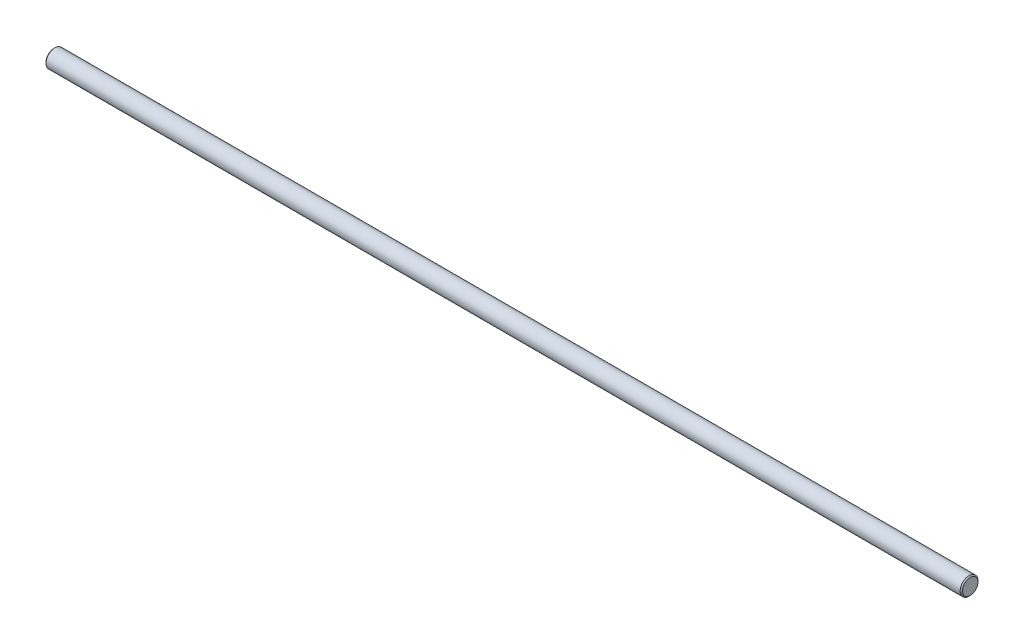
ISO-10303-21;
HEADER;
FILE_DESCRIPTION(('STEP AP214'),'2;1');
FILE_NAME('part.step','',(''),(''),'','','');
FILE_SCHEMA(('AUTOMOTIVE_DESIGN { 1 0 10303 214 1 1 1 1 }'));
ENDSEC;
DATA;
#1=APPLICATION_CONTEXT('core data for automotive mechanical design processes');
#2=APPLICATION_PROTOCOL_DEFINITION('international standard','automotive_design',2000,#1);
#3=PRODUCT_CONTEXT('',#1,'mechanical');
#4=PRODUCT('Part','Part','',(#3));
#5=PRODUCT_RELATED_PRODUCT_CATEGORY('part','',(#4));
#6=PRODUCT_DEFINITION_FORMATION('','',#4);
#7=PRODUCT_DEFINITION_CONTEXT('part definition',#1,'design');
#8=PRODUCT_DEFINITION('design','',#6,#7);
#9=PRODUCT_DEFINITION_SHAPE('','',#8);
#10=(LENGTH_UNIT() NAMED_UNIT(*) SI_UNIT(.MILLI.,.METRE.));
#11=(NAMED_UNIT(*) PLANE_ANGLE_UNIT() SI_UNIT($,.RADIAN.));
#12=(NAMED_UNIT(*) SI_UNIT($,.STERADIAN.) SOLID_ANGLE_UNIT());
#13=UNCERTAINTY_MEASURE_WITH_UNIT(LENGTH_MEASURE(1.E-05),#10,'distance_accuracy_value','');
#14=(GEOMETRIC_REPRESENTATION_CONTEXT(3) GLOBAL_UNCERTAINTY_ASSIGNED_CONTEXT((#13)) GLOBAL_UNIT_ASSIGNED_CONTEXT((#10,
#11,#12)) REPRESENTATION_CONTEXT('',''));
#15=CARTESIAN_POINT('',(0.,0.,0.));
#16=DIRECTION('',(0.,0.,1.));
#17=DIRECTION('',(1.,0.,0.));
#18=AXIS2_PLACEMENT_3D('',#15,#16,#17);
#19=CARTESIAN_POINT('',(0.,0.,0.));
#20=DIRECTION('',(1.,0.,0.));
#21=DIRECTION('',(0.,1.,0.));
#22=AXIS2_PLACEMENT_3D('',#19,#20,#21);
#23=PLANE('',#22);
#24=CARTESIAN_POINT('',(0.,0.,0.));
#25=DIRECTION('',(-1.,0.,0.));
#26=DIRECTION('',(0.,-1.,0.));
#27=AXIS2_PLACEMENT_3D('',#24,#25,#26);
#28=CIRCLE('',#27,3.5);
#29=CARTESIAN_POINT('',(0.,-3.5,0.));
#30=VERTEX_POINT('',#29);
#31=EDGE_CURVE('E10',#30,#30,#28,.T.);
#32=ORIENTED_EDGE('',*,*,#31,.T.);
#33=EDGE_LOOP('',(#32));
#34=FACE_BOUND('',#33,.T.);
#35=ADVANCED_FACE('F31',(#34),#23,.F.);
#36=CARTESIAN_POINT('',(0.5,0.,0.));
#37=DIRECTION('',(1.,0.,0.));
#38=DIRECTION('',(0.,1.,0.));
#39=AXIS2_PLACEMENT_3D('',#36,#37,#38);
#40=CONICAL_SURFACE('',#39,4.,0.785398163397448);
#41=ORIENTED_EDGE('',*,*,#31,.F.);
#42=EDGE_LOOP('',(#41));
#43=FACE_BOUND('',#42,.T.);
#44=CARTESIAN_POINT('',(0.5,0.,0.));
#45=DIRECTION('',(-1.,0.,0.));
#46=DIRECTION('',(0.,-1.,0.));
#47=AXIS2_PLACEMENT_3D('',#44,#45,#46);
#48=CIRCLE('',#47,4.);
#49=CARTESIAN_POINT('',(0.500000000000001,-4.,0.));
#50=VERTEX_POINT('',#49);
#51=EDGE_CURVE('E37',#50,#50,#48,.T.);
#52=ORIENTED_EDGE('',*,*,#51,.T.);
#53=EDGE_LOOP('',(#52));
#54=FACE_BOUND('',#53,.T.);
#55=ADVANCED_FACE('F63',(#43,#54),#40,.T.);
#56=CARTESIAN_POINT('',(410.,0.,0.));
#57=DIRECTION('',(-1.,0.,0.));
#58=DIRECTION('',(0.,-1.,0.));
#59=AXIS2_PLACEMENT_3D('',#56,#57,#58);
#60=CYLINDRICAL_SURFACE('',#59,3.99999999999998);
#61=ORIENTED_EDGE('',*,*,#51,.F.);
#62=EDGE_LOOP('',(#61));
#63=FACE_BOUND('',#62,.T.);
#64=CARTESIAN_POINT('',(409.5,0.,0.));
#65=DIRECTION('',(-1.,0.,0.));
#66=DIRECTION('',(0.,-1.,0.));
#67=AXIS2_PLACEMENT_3D('',#64,#65,#66);
#68=CIRCLE('',#67,3.99999999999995);
#69=CARTESIAN_POINT('',(409.5,-3.9999999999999,0.));
#70=VERTEX_POINT('',#69);
#71=EDGE_CURVE('E41',#70,#70,#68,.T.);
#72=ORIENTED_EDGE('',*,*,#71,.T.);
#73=EDGE_LOOP('',(#72));
#74=FACE_BOUND('',#73,.T.);
#75=ADVANCED_FACE('F59',(#63,#74),#60,.T.);
#76=CARTESIAN_POINT('',(410.,0.,0.));
#77=DIRECTION('',(-1.,0.,0.));
#78=DIRECTION('',(0.,-1.,0.));
#79=AXIS2_PLACEMENT_3D('',#76,#77,#78);
#80=CONICAL_SURFACE('',#79,3.49999999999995,0.785398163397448);
#81=ORIENTED_EDGE('',*,*,#71,.F.);
#82=EDGE_LOOP('',(#81));
#83=FACE_BOUND('',#82,.T.);
#84=CARTESIAN_POINT('',(410.,0.,0.));
#85=DIRECTION('',(-1.,0.,0.));
#86=DIRECTION('',(0.,-1.,0.));
#87=AXIS2_PLACEMENT_3D('',#84,#85,#86);
#88=CIRCLE('',#87,3.49999999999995);
#89=CARTESIAN_POINT('',(410.,-3.4999999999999,0.));
#90=VERTEX_POINT('',#89);
#91=EDGE_CURVE('E45',#90,#90,#88,.T.);
#92=ORIENTED_EDGE('',*,*,#91,.T.);
#93=EDGE_LOOP('',(#92));
#94=FACE_BOUND('',#93,.T.);
#95=ADVANCED_FACE('F51',(#83,#94),#80,.T.);
#96=CARTESIAN_POINT('',(410.,3.5,0.));
#97=DIRECTION('',(-1.,0.,0.));
#98=DIRECTION('',(0.,-1.,0.));
#99=AXIS2_PLACEMENT_3D('',#96,#97,#98);
#100=PLANE('',#99);
#101=ORIENTED_EDGE('',*,*,#91,.F.);
#102=EDGE_LOOP('',(#101));
#103=FACE_BOUND('',#102,.T.);
#104=ADVANCED_FACE('F53',(#103),#100,.F.);
#105=CLOSED_SHELL('',(#35,#55,#75,#95,#104));
#106=MANIFOLD_SOLID_BREP('B2',#105);
#107=ADVANCED_BREP_SHAPE_REPRESENTATION('',(#18,#106),#14);
#108=SHAPE_DEFINITION_REPRESENTATION(#9,#107);
ENDSEC;
END-ISO-10303-21;
